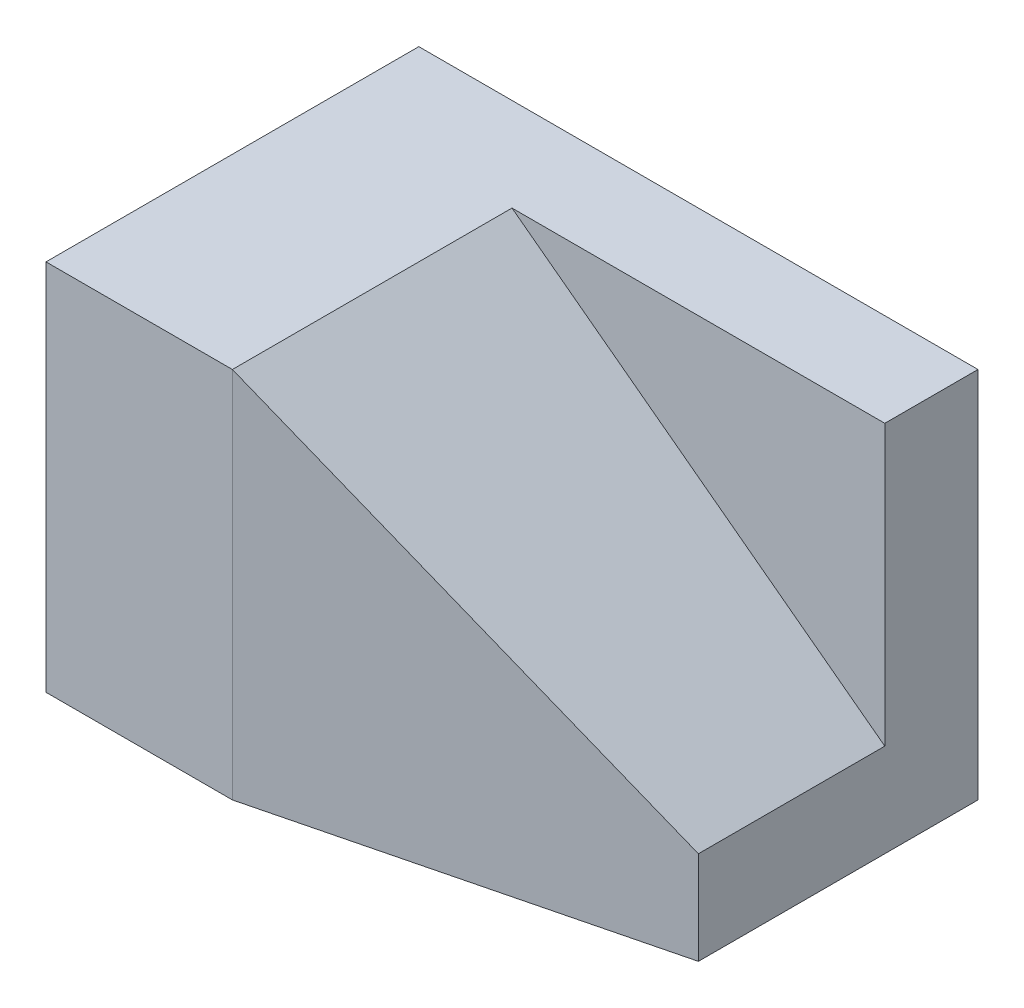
from build123d import *

# Parameters (mm, degrees)
SKETCH1_W      = 60
SKETCH1_H      = 40
EXTRUDE1_DEPTH = 40
EXTRUDE2_DEPTH = 30
CHAMFER1_SIZE  = 40
CHAMFER1_SIZE2 = 10


with BuildPart() as part:
    # Sketch1 → Extrude1 (new body)
    with BuildSketch(Plane(origin=(0, 0, 0), x_dir=(1, 0, 0), z_dir=(0, 1, 0))):
        Rectangle(SKETCH1_W, SKETCH1_H)
    extrude(amount=EXTRUDE1_DEPTH)

    # Sketch2 → Extrude2 (cut)
    with BuildSketch(Plane.XY.offset(20)):
        Polygon((-10, 40), (30, 10), (30, 40), align=None)
    extrude(amount=-EXTRUDE2_DEPTH, mode=Mode.SUBTRACT)

    # Chamfer1
    chamfer1_edges = [part.edges().sort_by_distance(p)[0] for p in [
        (30, 5, 20),
    ]]
    chamfer1_side = [part.faces().sort_by_distance(p)[0] for p in [
        (-5.555555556, 16.666666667, 20),
    ]]
    chamfer(chamfer1_edges, length=CHAMFER1_SIZE, length2=CHAMFER1_SIZE2, reference=chamfer1_side[0])


solid = part.part
